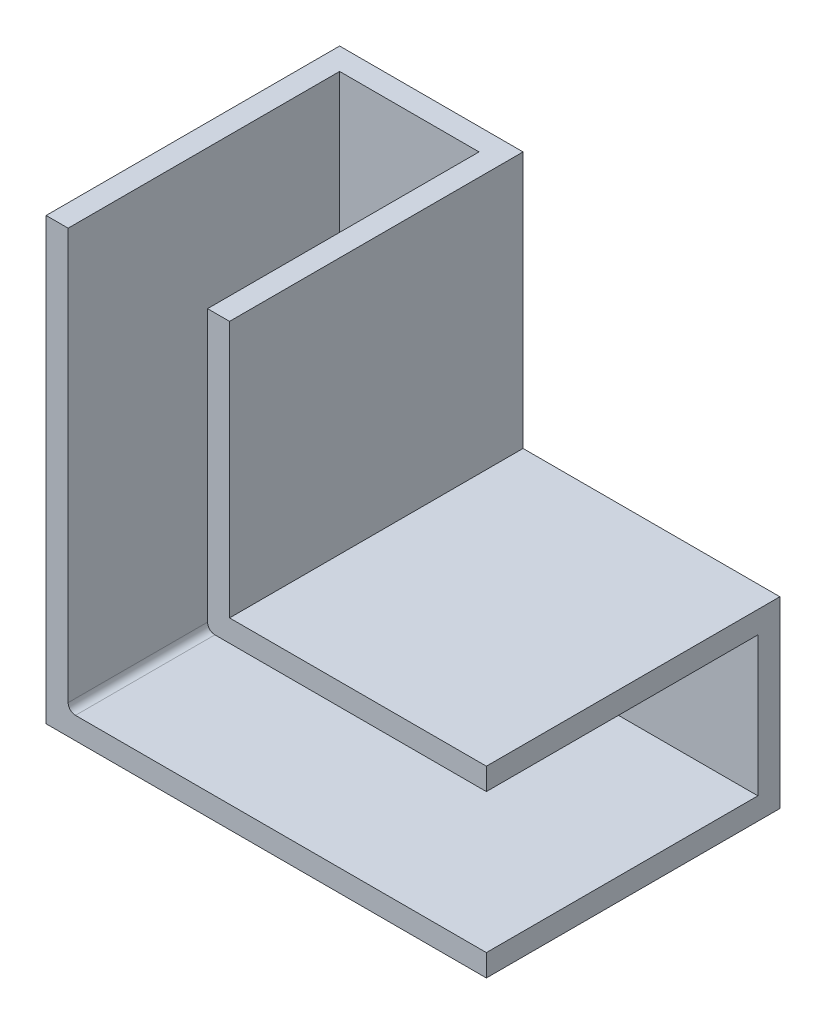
ISO-10303-21;
HEADER;
FILE_DESCRIPTION(('STEP AP214'),'2;1');
FILE_NAME('part.step','',(''),(''),'','','');
FILE_SCHEMA(('AUTOMOTIVE_DESIGN { 1 0 10303 214 1 1 1 1 }'));
ENDSEC;
DATA;
#1=APPLICATION_CONTEXT('core data for automotive mechanical design processes');
#2=APPLICATION_PROTOCOL_DEFINITION('international standard','automotive_design',2000,#1);
#3=PRODUCT_CONTEXT('',#1,'mechanical');
#4=PRODUCT('Part','Part','',(#3));
#5=PRODUCT_RELATED_PRODUCT_CATEGORY('part','',(#4));
#6=PRODUCT_DEFINITION_FORMATION('','',#4);
#7=PRODUCT_DEFINITION_CONTEXT('part definition',#1,'design');
#8=PRODUCT_DEFINITION('design','',#6,#7);
#9=PRODUCT_DEFINITION_SHAPE('','',#8);
#10=(LENGTH_UNIT() NAMED_UNIT(*) SI_UNIT(.MILLI.,.METRE.));
#11=(NAMED_UNIT(*) PLANE_ANGLE_UNIT() SI_UNIT($,.RADIAN.));
#12=(NAMED_UNIT(*) SI_UNIT($,.STERADIAN.) SOLID_ANGLE_UNIT());
#13=UNCERTAINTY_MEASURE_WITH_UNIT(LENGTH_MEASURE(1.E-05),#10,'distance_accuracy_value','');
#14=(GEOMETRIC_REPRESENTATION_CONTEXT(3) GLOBAL_UNCERTAINTY_ASSIGNED_CONTEXT((#13)) GLOBAL_UNIT_ASSIGNED_CONTEXT((#10,
#11,#12)) REPRESENTATION_CONTEXT('',''));
#15=CARTESIAN_POINT('',(0.,0.,0.));
#16=DIRECTION('',(0.,0.,1.));
#17=DIRECTION('',(1.,0.,0.));
#18=AXIS2_PLACEMENT_3D('',#15,#16,#17);
#19=CARTESIAN_POINT('',(0.,0.,40.));
#20=DIRECTION('',(0.,0.,1.));
#21=DIRECTION('',(1.,0.,0.));
#22=AXIS2_PLACEMENT_3D('',#19,#20,#21);
#23=PLANE('',#22);
#24=DIRECTION('',(0.,-1.,0.));
#25=VECTOR('',#24,1.);
#26=CARTESIAN_POINT('',(-47.5714285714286,22.6428571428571,40.));
#27=LINE('',#26,#25);
#28=CARTESIAN_POINT('',(-47.5714285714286,22.6428571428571,40.));
#29=VERTEX_POINT('',#28);
#30=CARTESIAN_POINT('',(-47.5714285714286,-33.3571428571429,40.));
#31=VERTEX_POINT('',#30);
#32=EDGE_CURVE('E148',#29,#31,#27,.T.);
#33=ORIENTED_EDGE('',*,*,#32,.F.);
#34=DIRECTION('',(-1.,0.,0.));
#35=VECTOR('',#34,1.);
#36=CARTESIAN_POINT('',(-50.5714285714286,22.6428571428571,40.));
#37=LINE('',#36,#35);
#38=CARTESIAN_POINT('',(-50.5714285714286,22.6428571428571,40.));
#39=VERTEX_POINT('',#38);
#40=EDGE_CURVE('E174',#29,#39,#37,.T.);
#41=ORIENTED_EDGE('',*,*,#40,.T.);
#42=DIRECTION('',(0.,-1.,0.));
#43=VECTOR('',#42,1.);
#44=CARTESIAN_POINT('',(-50.5714285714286,22.6428571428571,40.));
#45=LINE('',#44,#43);
#46=CARTESIAN_POINT('',(-50.5714285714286,-37.3571428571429,40.));
#47=VERTEX_POINT('',#46);
#48=EDGE_CURVE('E191',#39,#47,#45,.T.);
#49=ORIENTED_EDGE('',*,*,#48,.T.);
#50=DIRECTION('',(1.,0.,0.));
#51=VECTOR('',#50,1.);
#52=CARTESIAN_POINT('',(-50.5714285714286,-37.3571428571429,40.));
#53=LINE('',#52,#51);
#54=CARTESIAN_POINT('',(9.42857142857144,-37.3571428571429,40.));
#55=VERTEX_POINT('',#54);
#56=EDGE_CURVE('E163',#47,#55,#53,.T.);
#57=ORIENTED_EDGE('',*,*,#56,.T.);
#58=DIRECTION('',(0.,1.,0.));
#59=VECTOR('',#58,1.);
#60=CARTESIAN_POINT('',(9.42857142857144,-12.3571428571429,40.));
#61=LINE('',#60,#59);
#62=CARTESIAN_POINT('',(9.42857142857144,-34.3571428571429,40.));
#63=VERTEX_POINT('',#62);
#64=EDGE_CURVE('E155',#55,#63,#61,.T.);
#65=ORIENTED_EDGE('',*,*,#64,.T.);
#66=DIRECTION('',(1.,0.,0.));
#67=VECTOR('',#66,1.);
#68=CARTESIAN_POINT('',(-50.5714285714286,-34.3571428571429,40.));
#69=LINE('',#68,#67);
#70=CARTESIAN_POINT('',(-46.5714285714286,-34.3571428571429,40.));
#71=VERTEX_POINT('',#70);
#72=EDGE_CURVE('E136',#71,#63,#69,.T.);
#73=ORIENTED_EDGE('',*,*,#72,.F.);
#74=CARTESIAN_POINT('',(-46.5714285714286,-33.3571428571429,40.));
#75=DIRECTION('',(0.,0.,1.));
#76=DIRECTION('',(1.,0.,0.));
#77=AXIS2_PLACEMENT_3D('',#74,#75,#76);
#78=CIRCLE('',#77,1.);
#79=EDGE_CURVE('E42',#71,#31,#78,.F.);
#80=ORIENTED_EDGE('',*,*,#79,.T.);
#81=EDGE_LOOP('',(#33,#41,#49,#57,#65,#73,#80));
#82=FACE_BOUND('',#81,.T.);
#83=ADVANCED_FACE('F34',(#82),#23,.T.);
#84=CARTESIAN_POINT('',(-50.5714285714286,22.6428571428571,40.));
#85=DIRECTION('',(1.,0.,0.));
#86=DIRECTION('',(0.,0.,-1.));
#87=AXIS2_PLACEMENT_3D('',#84,#85,#86);
#88=PLANE('',#87);
#89=DIRECTION('',(0.,-1.,0.));
#90=VECTOR('',#89,1.);
#91=CARTESIAN_POINT('',(-50.5714285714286,22.6428571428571,0.));
#92=LINE('',#91,#90);
#93=CARTESIAN_POINT('',(-50.5714285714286,22.6428571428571,0.));
#94=VERTEX_POINT('',#93);
#95=CARTESIAN_POINT('',(-50.5714285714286,-37.3571428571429,0.));
#96=VERTEX_POINT('',#95);
#97=EDGE_CURVE('E158',#94,#96,#92,.T.);
#98=ORIENTED_EDGE('',*,*,#97,.T.);
#99=DIRECTION('',(0.,0.,-1.));
#100=VECTOR('',#99,1.);
#101=CARTESIAN_POINT('',(-50.5714285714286,-37.3571428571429,40.));
#102=LINE('',#101,#100);
#103=EDGE_CURVE('E205',#47,#96,#102,.T.);
#104=ORIENTED_EDGE('',*,*,#103,.F.);
#105=ORIENTED_EDGE('',*,*,#48,.F.);
#106=DIRECTION('',(0.,0.,-1.));
#107=VECTOR('',#106,1.);
#108=CARTESIAN_POINT('',(-50.5714285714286,22.6428571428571,40.));
#109=LINE('',#108,#107);
#110=EDGE_CURVE('E178',#39,#94,#109,.T.);
#111=ORIENTED_EDGE('',*,*,#110,.T.);
#112=EDGE_LOOP('',(#98,#104,#105,#111));
#113=FACE_BOUND('',#112,.T.);
#114=ADVANCED_FACE('F256',(#113),#88,.F.);
#115=CARTESIAN_POINT('',(-50.5714285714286,-37.3571428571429,40.));
#116=DIRECTION('',(0.,1.,0.));
#117=DIRECTION('',(0.,0.,1.));
#118=AXIS2_PLACEMENT_3D('',#115,#116,#117);
#119=PLANE('',#118);
#120=DIRECTION('',(1.,0.,0.));
#121=VECTOR('',#120,1.);
#122=CARTESIAN_POINT('',(-50.5714285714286,-37.3571428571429,0.));
#123=LINE('',#122,#121);
#124=CARTESIAN_POINT('',(9.42857142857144,-37.3571428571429,0.));
#125=VERTEX_POINT('',#124);
#126=EDGE_CURVE('E181',#96,#125,#123,.T.);
#127=ORIENTED_EDGE('',*,*,#126,.T.);
#128=DIRECTION('',(0.,0.,-1.));
#129=VECTOR('',#128,1.);
#130=CARTESIAN_POINT('',(9.42857142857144,-37.3571428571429,40.));
#131=LINE('',#130,#129);
#132=EDGE_CURVE('E203',#55,#125,#131,.T.);
#133=ORIENTED_EDGE('',*,*,#132,.F.);
#134=ORIENTED_EDGE('',*,*,#56,.F.);
#135=ORIENTED_EDGE('',*,*,#103,.T.);
#136=EDGE_LOOP('',(#127,#133,#134,#135));
#137=FACE_BOUND('',#136,.T.);
#138=ADVANCED_FACE('F259',(#137),#119,.F.);
#139=CARTESIAN_POINT('',(9.42857142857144,-12.3571428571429,40.));
#140=DIRECTION('',(-1.,0.,0.));
#141=DIRECTION('',(0.,-1.,0.));
#142=AXIS2_PLACEMENT_3D('',#139,#140,#141);
#143=PLANE('',#142);
#144=CARTESIAN_POINT('',(9.42857142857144,-15.3571428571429,40.));
#145=VERTEX_POINT('',#144);
#146=CARTESIAN_POINT('',(9.42857142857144,-12.3571428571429,40.));
#147=VERTEX_POINT('',#146);
#148=EDGE_CURVE('E166',#145,#147,#61,.T.);
#149=ORIENTED_EDGE('',*,*,#148,.F.);
#150=DIRECTION('',(0.,0.,-1.));
#151=VECTOR('',#150,1.);
#152=CARTESIAN_POINT('',(9.42857142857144,-15.3571428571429,40.));
#153=LINE('',#152,#151);
#154=CARTESIAN_POINT('',(9.42857142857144,-15.3571428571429,3.));
#155=VERTEX_POINT('',#154);
#156=EDGE_CURVE('E159',#145,#155,#153,.T.);
#157=ORIENTED_EDGE('',*,*,#156,.T.);
#158=DIRECTION('',(0.,1.,0.));
#159=VECTOR('',#158,1.);
#160=CARTESIAN_POINT('',(9.42857142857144,-12.3571428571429,3.));
#161=LINE('',#160,#159);
#162=CARTESIAN_POINT('',(9.42857142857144,-34.3571428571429,3.));
#163=VERTEX_POINT('',#162);
#164=EDGE_CURVE('E157',#163,#155,#161,.T.);
#165=ORIENTED_EDGE('',*,*,#164,.F.);
#166=DIRECTION('',(0.,0.,-1.));
#167=VECTOR('',#166,1.);
#168=CARTESIAN_POINT('',(9.42857142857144,-34.3571428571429,40.));
#169=LINE('',#168,#167);
#170=EDGE_CURVE('E140',#63,#163,#169,.T.);
#171=ORIENTED_EDGE('',*,*,#170,.F.);
#172=ORIENTED_EDGE('',*,*,#64,.F.);
#173=ORIENTED_EDGE('',*,*,#132,.T.);
#174=DIRECTION('',(0.,1.,0.));
#175=VECTOR('',#174,1.);
#176=CARTESIAN_POINT('',(9.42857142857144,-12.3571428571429,0.));
#177=LINE('',#176,#175);
#178=CARTESIAN_POINT('',(9.42857142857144,-12.3571428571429,0.));
#179=VERTEX_POINT('',#178);
#180=EDGE_CURVE('E183',#125,#179,#177,.T.);
#181=ORIENTED_EDGE('',*,*,#180,.T.);
#182=DIRECTION('',(0.,0.,-1.));
#183=VECTOR('',#182,1.);
#184=CARTESIAN_POINT('',(9.42857142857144,-12.3571428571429,40.));
#185=LINE('',#184,#183);
#186=EDGE_CURVE('E200',#147,#179,#185,.T.);
#187=ORIENTED_EDGE('',*,*,#186,.F.);
#188=EDGE_LOOP('',(#149,#157,#165,#171,#172,#173,#181,#187));
#189=FACE_BOUND('',#188,.T.);
#190=ADVANCED_FACE('F153',(#189),#143,.F.);
#191=CARTESIAN_POINT('',(-25.5714285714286,-12.3571428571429,40.));
#192=DIRECTION('',(0.,-1.,0.));
#193=DIRECTION('',(0.,0.,-1.));
#194=AXIS2_PLACEMENT_3D('',#191,#192,#193);
#195=PLANE('',#194);
#196=DIRECTION('',(-1.,0.,0.));
#197=VECTOR('',#196,1.);
#198=CARTESIAN_POINT('',(-25.5714285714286,-12.3571428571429,0.));
#199=LINE('',#198,#197);
#200=CARTESIAN_POINT('',(-25.5714285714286,-12.3571428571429,0.));
#201=VERTEX_POINT('',#200);
#202=EDGE_CURVE('E185',#179,#201,#199,.T.);
#203=ORIENTED_EDGE('',*,*,#202,.T.);
#204=DIRECTION('',(0.,0.,-1.));
#205=VECTOR('',#204,1.);
#206=CARTESIAN_POINT('',(-25.5714285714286,-12.3571428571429,40.));
#207=LINE('',#206,#205);
#208=CARTESIAN_POINT('',(-25.5714285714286,-12.3571428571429,40.));
#209=VERTEX_POINT('',#208);
#210=EDGE_CURVE('E197',#209,#201,#207,.T.);
#211=ORIENTED_EDGE('',*,*,#210,.F.);
#212=DIRECTION('',(-1.,0.,0.));
#213=VECTOR('',#212,1.);
#214=CARTESIAN_POINT('',(-25.5714285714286,-12.3571428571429,40.));
#215=LINE('',#214,#213);
#216=EDGE_CURVE('E165',#147,#209,#215,.T.);
#217=ORIENTED_EDGE('',*,*,#216,.F.);
#218=ORIENTED_EDGE('',*,*,#186,.T.);
#219=EDGE_LOOP('',(#203,#211,#217,#218));
#220=FACE_BOUND('',#219,.T.);
#221=ADVANCED_FACE('F269',(#220),#195,.F.);
#222=CARTESIAN_POINT('',(-25.5714285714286,22.6428571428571,40.));
#223=DIRECTION('',(-1.,0.,0.));
#224=DIRECTION('',(0.,-1.,0.));
#225=AXIS2_PLACEMENT_3D('',#222,#223,#224);
#226=PLANE('',#225);
#227=DIRECTION('',(0.,1.,0.));
#228=VECTOR('',#227,1.);
#229=CARTESIAN_POINT('',(-25.5714285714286,22.6428571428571,0.));
#230=LINE('',#229,#228);
#231=CARTESIAN_POINT('',(-25.5714285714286,22.6428571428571,0.));
#232=VERTEX_POINT('',#231);
#233=EDGE_CURVE('E187',#201,#232,#230,.T.);
#234=ORIENTED_EDGE('',*,*,#233,.T.);
#235=DIRECTION('',(0.,0.,-1.));
#236=VECTOR('',#235,1.);
#237=CARTESIAN_POINT('',(-25.5714285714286,22.6428571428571,40.));
#238=LINE('',#237,#236);
#239=CARTESIAN_POINT('',(-25.5714285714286,22.6428571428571,40.));
#240=VERTEX_POINT('',#239);
#241=EDGE_CURVE('E194',#240,#232,#238,.T.);
#242=ORIENTED_EDGE('',*,*,#241,.F.);
#243=DIRECTION('',(0.,1.,0.));
#244=VECTOR('',#243,1.);
#245=CARTESIAN_POINT('',(-25.5714285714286,22.6428571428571,40.));
#246=LINE('',#245,#244);
#247=EDGE_CURVE('E168',#209,#240,#246,.T.);
#248=ORIENTED_EDGE('',*,*,#247,.F.);
#249=ORIENTED_EDGE('',*,*,#210,.T.);
#250=EDGE_LOOP('',(#234,#242,#248,#249));
#251=FACE_BOUND('',#250,.T.);
#252=ADVANCED_FACE('F273',(#251),#226,.F.);
#253=CARTESIAN_POINT('',(-50.5714285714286,22.6428571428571,40.));
#254=DIRECTION('',(0.,-1.,0.));
#255=DIRECTION('',(0.,0.,-1.));
#256=AXIS2_PLACEMENT_3D('',#253,#254,#255);
#257=PLANE('',#256);
#258=ORIENTED_EDGE('',*,*,#40,.F.);
#259=DIRECTION('',(0.,0.,-1.));
#260=VECTOR('',#259,1.);
#261=CARTESIAN_POINT('',(-47.5714285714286,22.6428571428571,40.));
#262=LINE('',#261,#260);
#263=CARTESIAN_POINT('',(-47.5714285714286,22.6428571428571,3.));
#264=VERTEX_POINT('',#263);
#265=EDGE_CURVE('E227',#29,#264,#262,.T.);
#266=ORIENTED_EDGE('',*,*,#265,.T.);
#267=DIRECTION('',(-1.,0.,0.));
#268=VECTOR('',#267,1.);
#269=CARTESIAN_POINT('',(-50.5714285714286,22.6428571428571,3.));
#270=LINE('',#269,#268);
#271=CARTESIAN_POINT('',(-28.5714285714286,22.6428571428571,3.));
#272=VERTEX_POINT('',#271);
#273=EDGE_CURVE('E228',#272,#264,#270,.T.);
#274=ORIENTED_EDGE('',*,*,#273,.F.);
#275=DIRECTION('',(0.,0.,-1.));
#276=VECTOR('',#275,1.);
#277=CARTESIAN_POINT('',(-28.5714285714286,22.6428571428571,40.));
#278=LINE('',#277,#276);
#279=CARTESIAN_POINT('',(-28.5714285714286,22.6428571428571,40.));
#280=VERTEX_POINT('',#279);
#281=EDGE_CURVE('E245',#280,#272,#278,.T.);
#282=ORIENTED_EDGE('',*,*,#281,.F.);
#283=EDGE_CURVE('E175',#240,#280,#37,.T.);
#284=ORIENTED_EDGE('',*,*,#283,.F.);
#285=ORIENTED_EDGE('',*,*,#241,.T.);
#286=DIRECTION('',(-1.,0.,0.));
#287=VECTOR('',#286,1.);
#288=CARTESIAN_POINT('',(-50.5714285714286,22.6428571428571,0.));
#289=LINE('',#288,#287);
#290=EDGE_CURVE('E189',#232,#94,#289,.T.);
#291=ORIENTED_EDGE('',*,*,#290,.T.);
#292=ORIENTED_EDGE('',*,*,#110,.F.);
#293=EDGE_LOOP('',(#258,#266,#274,#282,#284,#285,#291,#292));
#294=FACE_BOUND('',#293,.T.);
#295=ADVANCED_FACE('F298',(#294),#257,.F.);
#296=DIRECTION('',(0.,1.,0.));
#297=VECTOR('',#296,1.);
#298=CARTESIAN_POINT('',(-28.5714285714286,22.6428571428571,40.));
#299=LINE('',#298,#297);
#300=CARTESIAN_POINT('',(-28.5714285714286,-14.3571428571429,40.));
#301=VERTEX_POINT('',#300);
#302=EDGE_CURVE('E247',#301,#280,#299,.T.);
#303=ORIENTED_EDGE('',*,*,#302,.F.);
#304=CARTESIAN_POINT('',(-27.5714285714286,-14.3571428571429,40.));
#305=DIRECTION('',(0.,0.,1.));
#306=DIRECTION('',(1.,0.,0.));
#307=AXIS2_PLACEMENT_3D('',#304,#305,#306);
#308=CIRCLE('',#307,1.);
#309=CARTESIAN_POINT('',(-27.5714285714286,-15.3571428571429,40.));
#310=VERTEX_POINT('',#309);
#311=EDGE_CURVE('E56',#301,#310,#308,.T.);
#312=ORIENTED_EDGE('',*,*,#311,.T.);
#313=DIRECTION('',(-1.,0.,0.));
#314=VECTOR('',#313,1.);
#315=CARTESIAN_POINT('',(-25.5714285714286,-15.3571428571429,40.));
#316=LINE('',#315,#314);
#317=EDGE_CURVE('E147',#145,#310,#316,.T.);
#318=ORIENTED_EDGE('',*,*,#317,.F.);
#319=ORIENTED_EDGE('',*,*,#148,.T.);
#320=ORIENTED_EDGE('',*,*,#216,.T.);
#321=ORIENTED_EDGE('',*,*,#247,.T.);
#322=ORIENTED_EDGE('',*,*,#283,.T.);
#323=EDGE_LOOP('',(#303,#312,#318,#319,#320,#321,#322));
#324=FACE_BOUND('',#323,.T.);
#325=ADVANCED_FACE('F276',(#324),#23,.T.);
#326=CARTESIAN_POINT('',(0.,0.,0.));
#327=DIRECTION('',(0.,0.,1.));
#328=DIRECTION('',(1.,0.,0.));
#329=AXIS2_PLACEMENT_3D('',#326,#327,#328);
#330=PLANE('',#329);
#331=ORIENTED_EDGE('',*,*,#97,.F.);
#332=ORIENTED_EDGE('',*,*,#290,.F.);
#333=ORIENTED_EDGE('',*,*,#233,.F.);
#334=ORIENTED_EDGE('',*,*,#202,.F.);
#335=ORIENTED_EDGE('',*,*,#180,.F.);
#336=ORIENTED_EDGE('',*,*,#126,.F.);
#337=EDGE_LOOP('',(#331,#332,#333,#334,#335,#336));
#338=FACE_BOUND('',#337,.T.);
#339=ADVANCED_FACE('F264',(#338),#330,.F.);
#340=CARTESIAN_POINT('',(-47.5714285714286,22.6428571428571,40.));
#341=DIRECTION('',(1.,0.,0.));
#342=DIRECTION('',(0.,0.,-1.));
#343=AXIS2_PLACEMENT_3D('',#340,#341,#342);
#344=PLANE('',#343);
#345=ORIENTED_EDGE('',*,*,#32,.T.);
#346=DIRECTION('',(0.,0.,-1.));
#347=VECTOR('',#346,1.);
#348=CARTESIAN_POINT('',(-47.5714285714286,-33.3571428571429,3.));
#349=LINE('',#348,#347);
#350=CARTESIAN_POINT('',(-47.5714285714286,-33.3571428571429,3.));
#351=VERTEX_POINT('',#350);
#352=EDGE_CURVE('E208',#31,#351,#349,.T.);
#353=ORIENTED_EDGE('',*,*,#352,.T.);
#354=DIRECTION('',(0.,-1.,0.));
#355=VECTOR('',#354,1.);
#356=CARTESIAN_POINT('',(-47.5714285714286,22.6428571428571,3.));
#357=LINE('',#356,#355);
#358=EDGE_CURVE('E234',#264,#351,#357,.T.);
#359=ORIENTED_EDGE('',*,*,#358,.F.);
#360=ORIENTED_EDGE('',*,*,#265,.F.);
#361=EDGE_LOOP('',(#345,#353,#359,#360));
#362=FACE_BOUND('',#361,.T.);
#363=ADVANCED_FACE('F223',(#362),#344,.T.);
#364=CARTESIAN_POINT('',(-50.5714285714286,-34.3571428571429,40.));
#365=DIRECTION('',(0.,1.,0.));
#366=DIRECTION('',(0.,0.,1.));
#367=AXIS2_PLACEMENT_3D('',#364,#365,#366);
#368=PLANE('',#367);
#369=DIRECTION('',(1.,0.,0.));
#370=VECTOR('',#369,1.);
#371=CARTESIAN_POINT('',(-50.5714285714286,-34.3571428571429,3.));
#372=LINE('',#371,#370);
#373=CARTESIAN_POINT('',(-46.5714285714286,-34.3571428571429,3.));
#374=VERTEX_POINT('',#373);
#375=EDGE_CURVE('E233',#374,#163,#372,.T.);
#376=ORIENTED_EDGE('',*,*,#375,.F.);
#377=DIRECTION('',(0.,0.,-1.));
#378=VECTOR('',#377,1.);
#379=CARTESIAN_POINT('',(-46.5714285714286,-34.3571428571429,40.));
#380=LINE('',#379,#378);
#381=EDGE_CURVE('E143',#374,#71,#380,.F.);
#382=ORIENTED_EDGE('',*,*,#381,.T.);
#383=ORIENTED_EDGE('',*,*,#72,.T.);
#384=ORIENTED_EDGE('',*,*,#170,.T.);
#385=EDGE_LOOP('',(#376,#382,#383,#384));
#386=FACE_BOUND('',#385,.T.);
#387=ADVANCED_FACE('F139',(#386),#368,.T.);
#388=CARTESIAN_POINT('',(-25.5714285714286,-15.3571428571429,40.));
#389=DIRECTION('',(0.,-1.,0.));
#390=DIRECTION('',(0.,0.,-1.));
#391=AXIS2_PLACEMENT_3D('',#388,#389,#390);
#392=PLANE('',#391);
#393=ORIENTED_EDGE('',*,*,#317,.T.);
#394=DIRECTION('',(0.,0.,-1.));
#395=VECTOR('',#394,1.);
#396=CARTESIAN_POINT('',(-27.5714285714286,-15.3571428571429,40.));
#397=LINE('',#396,#395);
#398=CARTESIAN_POINT('',(-27.5714285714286,-15.3571428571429,3.));
#399=VERTEX_POINT('',#398);
#400=EDGE_CURVE('E214',#310,#399,#397,.T.);
#401=ORIENTED_EDGE('',*,*,#400,.T.);
#402=DIRECTION('',(-1.,0.,0.));
#403=VECTOR('',#402,1.);
#404=CARTESIAN_POINT('',(-25.5714285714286,-15.3571428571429,3.));
#405=LINE('',#404,#403);
#406=EDGE_CURVE('E236',#155,#399,#405,.T.);
#407=ORIENTED_EDGE('',*,*,#406,.F.);
#408=ORIENTED_EDGE('',*,*,#156,.F.);
#409=EDGE_LOOP('',(#393,#401,#407,#408));
#410=FACE_BOUND('',#409,.T.);
#411=ADVANCED_FACE('F279',(#410),#392,.T.);
#412=CARTESIAN_POINT('',(-28.5714285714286,22.6428571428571,40.));
#413=DIRECTION('',(-1.,0.,0.));
#414=DIRECTION('',(0.,-1.,0.));
#415=AXIS2_PLACEMENT_3D('',#412,#413,#414);
#416=PLANE('',#415);
#417=DIRECTION('',(0.,1.,0.));
#418=VECTOR('',#417,1.);
#419=CARTESIAN_POINT('',(-28.5714285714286,22.6428571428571,3.));
#420=LINE('',#419,#418);
#421=CARTESIAN_POINT('',(-28.5714285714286,-14.3571428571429,3.));
#422=VERTEX_POINT('',#421);
#423=EDGE_CURVE('E240',#422,#272,#420,.T.);
#424=ORIENTED_EDGE('',*,*,#423,.F.);
#425=DIRECTION('',(0.,0.,-1.));
#426=VECTOR('',#425,1.);
#427=CARTESIAN_POINT('',(-28.5714285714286,-14.3571428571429,40.));
#428=LINE('',#427,#426);
#429=EDGE_CURVE('E49',#422,#301,#428,.F.);
#430=ORIENTED_EDGE('',*,*,#429,.T.);
#431=ORIENTED_EDGE('',*,*,#302,.T.);
#432=ORIENTED_EDGE('',*,*,#281,.T.);
#433=EDGE_LOOP('',(#424,#430,#431,#432));
#434=FACE_BOUND('',#433,.T.);
#435=ADVANCED_FACE('F282',(#434),#416,.T.);
#436=CARTESIAN_POINT('',(0.,0.,3.));
#437=DIRECTION('',(0.,0.,1.));
#438=DIRECTION('',(1.,0.,0.));
#439=AXIS2_PLACEMENT_3D('',#436,#437,#438);
#440=PLANE('',#439);
#441=ORIENTED_EDGE('',*,*,#358,.T.);
#442=CARTESIAN_POINT('',(-46.5714285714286,-33.3571428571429,3.));
#443=DIRECTION('',(0.,0.,1.));
#444=DIRECTION('',(1.,0.,0.));
#445=AXIS2_PLACEMENT_3D('',#442,#443,#444);
#446=CIRCLE('',#445,1.);
#447=EDGE_CURVE('E211',#351,#374,#446,.T.);
#448=ORIENTED_EDGE('',*,*,#447,.T.);
#449=ORIENTED_EDGE('',*,*,#375,.T.);
#450=ORIENTED_EDGE('',*,*,#164,.T.);
#451=ORIENTED_EDGE('',*,*,#406,.T.);
#452=CARTESIAN_POINT('',(-27.5714285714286,-14.3571428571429,3.));
#453=DIRECTION('',(0.,0.,1.));
#454=DIRECTION('',(1.,0.,0.));
#455=AXIS2_PLACEMENT_3D('',#452,#453,#454);
#456=CIRCLE('',#455,1.);
#457=EDGE_CURVE('E11',#399,#422,#456,.F.);
#458=ORIENTED_EDGE('',*,*,#457,.T.);
#459=ORIENTED_EDGE('',*,*,#423,.T.);
#460=ORIENTED_EDGE('',*,*,#273,.T.);
#461=EDGE_LOOP('',(#441,#448,#449,#450,#451,#458,#459,#460));
#462=FACE_BOUND('',#461,.T.);
#463=ADVANCED_FACE('F232',(#462),#440,.T.);
#464=CARTESIAN_POINT('',(-46.5714285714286,-33.3571428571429,40.));
#465=DIRECTION('',(0.,0.,1.));
#466=DIRECTION('',(1.,0.,0.));
#467=AXIS2_PLACEMENT_3D('',#464,#465,#466);
#468=CYLINDRICAL_SURFACE('',#467,1.);
#469=ORIENTED_EDGE('',*,*,#79,.F.);
#470=ORIENTED_EDGE('',*,*,#381,.F.);
#471=ORIENTED_EDGE('',*,*,#447,.F.);
#472=ORIENTED_EDGE('',*,*,#352,.F.);
#473=EDGE_LOOP('',(#469,#470,#471,#472));
#474=FACE_BOUND('',#473,.T.);
#475=ADVANCED_FACE('F230',(#474),#468,.F.);
#476=CARTESIAN_POINT('',(-27.5714285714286,-14.3571428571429,40.));
#477=DIRECTION('',(0.,0.,-1.));
#478=DIRECTION('',(-1.,0.,0.));
#479=AXIS2_PLACEMENT_3D('',#476,#477,#478);
#480=CYLINDRICAL_SURFACE('',#479,1.);
#481=ORIENTED_EDGE('',*,*,#311,.F.);
#482=ORIENTED_EDGE('',*,*,#429,.F.);
#483=ORIENTED_EDGE('',*,*,#457,.F.);
#484=ORIENTED_EDGE('',*,*,#400,.F.);
#485=EDGE_LOOP('',(#481,#482,#483,#484));
#486=FACE_BOUND('',#485,.T.);
#487=ADVANCED_FACE('F36',(#486),#480,.T.);
#488=CLOSED_SHELL('',(#83,#114,#138,#190,#221,#252,#295,#325,#339,#363,#387,#411,#435,#463,#475,#487));
#489=MANIFOLD_SOLID_BREP('B2',#488);
#490=ADVANCED_BREP_SHAPE_REPRESENTATION('',(#18,#489),#14);
#491=SHAPE_DEFINITION_REPRESENTATION(#9,#490);
ENDSEC;
END-ISO-10303-21;
